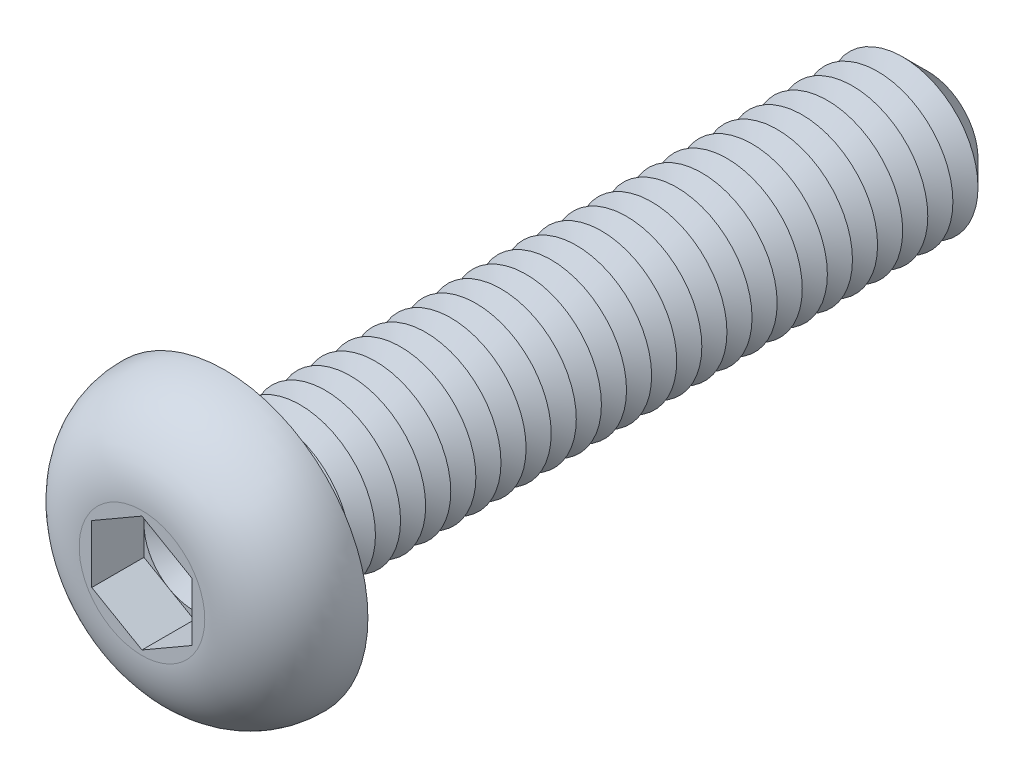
ISO-10303-21;
HEADER;
FILE_DESCRIPTION(('STEP AP214'),'2;1');
FILE_NAME('part.step','',(''),(''),'','','');
FILE_SCHEMA(('AUTOMOTIVE_DESIGN { 1 0 10303 214 1 1 1 1 }'));
ENDSEC;
DATA;
#1=APPLICATION_CONTEXT('core data for automotive mechanical design processes');
#2=APPLICATION_PROTOCOL_DEFINITION('international standard','automotive_design',2000,#1);
#3=PRODUCT_CONTEXT('',#1,'mechanical');
#4=PRODUCT('Part','Part','',(#3));
#5=PRODUCT_RELATED_PRODUCT_CATEGORY('part','',(#4));
#6=PRODUCT_DEFINITION_FORMATION('','',#4);
#7=PRODUCT_DEFINITION_CONTEXT('part definition',#1,'design');
#8=PRODUCT_DEFINITION('design','',#6,#7);
#9=PRODUCT_DEFINITION_SHAPE('','',#8);
#10=(LENGTH_UNIT() NAMED_UNIT(*) SI_UNIT(.MILLI.,.METRE.));
#11=(NAMED_UNIT(*) PLANE_ANGLE_UNIT() SI_UNIT($,.RADIAN.));
#12=(NAMED_UNIT(*) SI_UNIT($,.STERADIAN.) SOLID_ANGLE_UNIT());
#13=UNCERTAINTY_MEASURE_WITH_UNIT(LENGTH_MEASURE(1.E-05),#10,'distance_accuracy_value','');
#14=(GEOMETRIC_REPRESENTATION_CONTEXT(3) GLOBAL_UNCERTAINTY_ASSIGNED_CONTEXT((#13)) GLOBAL_UNIT_ASSIGNED_CONTEXT((#10,
#11,#12)) REPRESENTATION_CONTEXT('',''));
#15=CARTESIAN_POINT('',(0.,0.,0.));
#16=DIRECTION('',(0.,0.,1.));
#17=DIRECTION('',(1.,0.,0.));
#18=AXIS2_PLACEMENT_3D('',#15,#16,#17);
#19=CARTESIAN_POINT('',(0.,0.,0.61));
#20=DIRECTION('',(0.,0.,1.));
#21=DIRECTION('',(1.,0.,0.));
#22=AXIS2_PLACEMENT_3D('',#19,#20,#21);
#23=PLANE('',#22);
#24=CARTESIAN_POINT('',(0.,0.,0.61));
#25=DIRECTION('',(0.,0.,1.));
#26=DIRECTION('',(1.,0.,0.));
#27=AXIS2_PLACEMENT_3D('',#24,#25,#26);
#28=CIRCLE('',#27,1.);
#29=CARTESIAN_POINT('',(1.,0.,0.61));
#30=VERTEX_POINT('',#29);
#31=CARTESIAN_POINT('',(0.5,0.866025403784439,0.61));
#32=VERTEX_POINT('',#31);
#33=EDGE_CURVE('E117',#30,#32,#28,.T.);
#34=ORIENTED_EDGE('',*,*,#33,.F.);
#35=DIRECTION('',(0.,1.,0.));
#36=VECTOR('',#35,1.);
#37=CARTESIAN_POINT('',(1.,-0.577350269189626,0.61));
#38=LINE('',#37,#36);
#39=CARTESIAN_POINT('',(1.,0.577350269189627,0.61));
#40=VERTEX_POINT('',#39);
#41=EDGE_CURVE('E140',#30,#40,#38,.T.);
#42=ORIENTED_EDGE('',*,*,#41,.T.);
#43=DIRECTION('',(-0.866025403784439,0.5,0.));
#44=VECTOR('',#43,1.);
#45=CARTESIAN_POINT('',(1.,0.577350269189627,0.61));
#46=LINE('',#45,#44);
#47=EDGE_CURVE('E135',#40,#32,#46,.T.);
#48=ORIENTED_EDGE('',*,*,#47,.T.);
#49=EDGE_LOOP('',(#34,#42,#48));
#50=FACE_BOUND('',#49,.T.);
#51=ADVANCED_FACE('F39',(#50),#23,.T.);
#52=CARTESIAN_POINT('',(0.,0.,0.61));
#53=DIRECTION('',(0.,0.,1.));
#54=DIRECTION('',(1.,0.,0.));
#55=AXIS2_PLACEMENT_3D('',#52,#53,#54);
#56=CIRCLE('',#55,1.);
#57=CARTESIAN_POINT('',(-0.5,0.866025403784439,0.61));
#58=VERTEX_POINT('',#57);
#59=EDGE_CURVE('E11',#32,#58,#56,.T.);
#60=ORIENTED_EDGE('',*,*,#59,.F.);
#61=CARTESIAN_POINT('',(0.,1.15470053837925,0.61));
#62=VERTEX_POINT('',#61);
#63=EDGE_CURVE('E130',#32,#62,#46,.T.);
#64=ORIENTED_EDGE('',*,*,#63,.T.);
#65=DIRECTION('',(-0.866025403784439,-0.5,0.));
#66=VECTOR('',#65,1.);
#67=CARTESIAN_POINT('',(0.,1.15470053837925,0.61));
#68=LINE('',#67,#66);
#69=EDGE_CURVE('E132',#62,#58,#68,.T.);
#70=ORIENTED_EDGE('',*,*,#69,.T.);
#71=EDGE_LOOP('',(#60,#64,#70));
#72=FACE_BOUND('',#71,.T.);
#73=ADVANCED_FACE('F129',(#72),#23,.T.);
#74=CARTESIAN_POINT('',(-1.,0.,0.61));
#75=VERTEX_POINT('',#74);
#76=EDGE_CURVE('E49',#58,#75,#56,.T.);
#77=ORIENTED_EDGE('',*,*,#76,.F.);
#78=CARTESIAN_POINT('',(-1.,0.577350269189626,0.61));
#79=VERTEX_POINT('',#78);
#80=EDGE_CURVE('E143',#58,#79,#68,.T.);
#81=ORIENTED_EDGE('',*,*,#80,.T.);
#82=DIRECTION('',(0.,-1.,0.));
#83=VECTOR('',#82,1.);
#84=CARTESIAN_POINT('',(-1.,0.577350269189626,0.61));
#85=LINE('',#84,#83);
#86=EDGE_CURVE('E154',#79,#75,#85,.T.);
#87=ORIENTED_EDGE('',*,*,#86,.T.);
#88=EDGE_LOOP('',(#77,#81,#87));
#89=FACE_BOUND('',#88,.T.);
#90=ADVANCED_FACE('F253',(#89),#23,.T.);
#91=CARTESIAN_POINT('',(-0.5,-0.866025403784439,0.61));
#92=VERTEX_POINT('',#91);
#93=EDGE_CURVE('E233',#75,#92,#56,.T.);
#94=ORIENTED_EDGE('',*,*,#93,.F.);
#95=CARTESIAN_POINT('',(-1.,-0.577350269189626,0.61));
#96=VERTEX_POINT('',#95);
#97=EDGE_CURVE('E153',#75,#96,#85,.T.);
#98=ORIENTED_EDGE('',*,*,#97,.T.);
#99=DIRECTION('',(0.866025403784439,-0.5,0.));
#100=VECTOR('',#99,1.);
#101=CARTESIAN_POINT('',(-1.,-0.577350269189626,0.61));
#102=LINE('',#101,#100);
#103=EDGE_CURVE('E159',#96,#92,#102,.T.);
#104=ORIENTED_EDGE('',*,*,#103,.T.);
#105=EDGE_LOOP('',(#94,#98,#104));
#106=FACE_BOUND('',#105,.T.);
#107=ADVANCED_FACE('F246',(#106),#23,.T.);
#108=CARTESIAN_POINT('',(0.5,-0.866025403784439,0.61));
#109=VERTEX_POINT('',#108);
#110=EDGE_CURVE('E56',#92,#109,#56,.T.);
#111=ORIENTED_EDGE('',*,*,#110,.F.);
#112=CARTESIAN_POINT('',(0.,-1.15470053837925,0.61));
#113=VERTEX_POINT('',#112);
#114=EDGE_CURVE('E158',#92,#113,#102,.T.);
#115=ORIENTED_EDGE('',*,*,#114,.T.);
#116=DIRECTION('',(0.866025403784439,0.5,0.));
#117=VECTOR('',#116,1.);
#118=CARTESIAN_POINT('',(0.,-1.15470053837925,0.61));
#119=LINE('',#118,#117);
#120=EDGE_CURVE('E164',#113,#109,#119,.T.);
#121=ORIENTED_EDGE('',*,*,#120,.T.);
#122=EDGE_LOOP('',(#111,#115,#121));
#123=FACE_BOUND('',#122,.T.);
#124=ADVANCED_FACE('F492',(#123),#23,.T.);
#125=CARTESIAN_POINT('',(0.,0.,-14.));
#126=DIRECTION('',(0.,0.,1.));
#127=DIRECTION('',(1.,0.,0.));
#128=AXIS2_PLACEMENT_3D('',#125,#126,#127);
#129=CYLINDRICAL_SURFACE('',#128,1.5);
#130=CARTESIAN_POINT('',(0.,0.,-0.200000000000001));
#131=DIRECTION('',(0.,0.,1.));
#132=DIRECTION('',(1.,0.,0.));
#133=AXIS2_PLACEMENT_3D('',#130,#131,#132);
#134=CIRCLE('',#133,1.5);
#135=CARTESIAN_POINT('',(1.5,0.,-0.200000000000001));
#136=VERTEX_POINT('',#135);
#137=EDGE_CURVE('E221',#136,#136,#134,.F.);
#138=ORIENTED_EDGE('',*,*,#137,.T.);
#139=EDGE_LOOP('',(#138));
#140=FACE_BOUND('',#139,.T.);
#141=CARTESIAN_POINT('',(0.,0.,-0.5));
#142=DIRECTION('',(0.,0.,1.));
#143=DIRECTION('',(1.,0.,0.));
#144=AXIS2_PLACEMENT_3D('',#141,#142,#143);
#145=CIRCLE('',#144,1.50000000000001);
#146=CARTESIAN_POINT('',(1.50000000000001,0.,-0.5));
#147=VERTEX_POINT('',#146);
#148=EDGE_CURVE('E149',#147,#147,#145,.T.);
#149=ORIENTED_EDGE('',*,*,#148,.T.);
#150=EDGE_LOOP('',(#149));
#151=FACE_BOUND('',#150,.T.);
#152=ADVANCED_FACE('F498',(#140,#151),#129,.T.);
#153=CARTESIAN_POINT('',(0.,2.85,0.));
#154=DIRECTION('',(0.,0.,1.));
#155=DIRECTION('',(1.,0.,0.));
#156=AXIS2_PLACEMENT_3D('',#153,#154,#155);
#157=PLANE('',#156);
#158=CARTESIAN_POINT('',(0.,0.,0.));
#159=DIRECTION('',(0.,0.,1.));
#160=DIRECTION('',(1.,0.,0.));
#161=AXIS2_PLACEMENT_3D('',#158,#159,#160);
#162=CIRCLE('',#161,1.7);
#163=CARTESIAN_POINT('',(1.7,0.,0.));
#164=VERTEX_POINT('',#163);
#165=EDGE_CURVE('E224',#164,#164,#162,.T.);
#166=ORIENTED_EDGE('',*,*,#165,.T.);
#167=EDGE_LOOP('',(#166));
#168=FACE_BOUND('',#167,.T.);
#169=CARTESIAN_POINT('',(0.,0.,0.));
#170=DIRECTION('',(0.,0.,1.));
#171=DIRECTION('',(1.,0.,0.));
#172=AXIS2_PLACEMENT_3D('',#169,#170,#171);
#173=CIRCLE('',#172,2.85);
#174=CARTESIAN_POINT('',(2.85,0.,0.));
#175=VERTEX_POINT('',#174);
#176=EDGE_CURVE('E195',#175,#175,#173,.T.);
#177=ORIENTED_EDGE('',*,*,#176,.F.);
#178=EDGE_LOOP('',(#177));
#179=FACE_BOUND('',#178,.T.);
#180=ADVANCED_FACE('F503',(#168,#179),#157,.F.);
#181=CARTESIAN_POINT('',(0.,0.,1.65));
#182=DIRECTION('',(0.,0.,-1.));
#183=DIRECTION('',(-1.,0.,0.));
#184=AXIS2_PLACEMENT_3D('',#181,#182,#183);
#185=PLANE('',#184);
#186=DIRECTION('',(-0.866025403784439,-0.5,0.));
#187=VECTOR('',#186,1.);
#188=CARTESIAN_POINT('',(0.,1.15470053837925,1.65));
#189=LINE('',#188,#187);
#190=CARTESIAN_POINT('',(0.,1.15470053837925,1.65));
#191=VERTEX_POINT('',#190);
#192=CARTESIAN_POINT('',(-1.,0.577350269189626,1.65));
#193=VERTEX_POINT('',#192);
#194=EDGE_CURVE('E173',#191,#193,#189,.T.);
#195=ORIENTED_EDGE('',*,*,#194,.F.);
#196=DIRECTION('',(-0.866025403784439,0.5,0.));
#197=VECTOR('',#196,1.);
#198=CARTESIAN_POINT('',(1.,0.577350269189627,1.65));
#199=LINE('',#198,#197);
#200=CARTESIAN_POINT('',(1.,0.577350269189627,1.65));
#201=VERTEX_POINT('',#200);
#202=EDGE_CURVE('E64',#201,#191,#199,.T.);
#203=ORIENTED_EDGE('',*,*,#202,.F.);
#204=DIRECTION('',(0.,1.,0.));
#205=VECTOR('',#204,1.);
#206=CARTESIAN_POINT('',(1.,-0.577350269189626,1.65));
#207=LINE('',#206,#205);
#208=CARTESIAN_POINT('',(1.,-0.577350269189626,1.65));
#209=VERTEX_POINT('',#208);
#210=EDGE_CURVE('E138',#209,#201,#207,.T.);
#211=ORIENTED_EDGE('',*,*,#210,.F.);
#212=DIRECTION('',(0.866025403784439,0.5,0.));
#213=VECTOR('',#212,1.);
#214=CARTESIAN_POINT('',(0.,-1.15470053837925,1.65));
#215=LINE('',#214,#213);
#216=CARTESIAN_POINT('',(0.,-1.15470053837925,1.65));
#217=VERTEX_POINT('',#216);
#218=EDGE_CURVE('E185',#217,#209,#215,.T.);
#219=ORIENTED_EDGE('',*,*,#218,.F.);
#220=DIRECTION('',(0.866025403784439,-0.5,0.));
#221=VECTOR('',#220,1.);
#222=CARTESIAN_POINT('',(-1.,-0.577350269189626,1.65));
#223=LINE('',#222,#221);
#224=CARTESIAN_POINT('',(-1.,-0.577350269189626,1.65));
#225=VERTEX_POINT('',#224);
#226=EDGE_CURVE('E181',#225,#217,#223,.T.);
#227=ORIENTED_EDGE('',*,*,#226,.F.);
#228=DIRECTION('',(0.,-1.,0.));
#229=VECTOR('',#228,1.);
#230=CARTESIAN_POINT('',(-1.,0.577350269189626,1.65));
#231=LINE('',#230,#229);
#232=EDGE_CURVE('E177',#193,#225,#231,.T.);
#233=ORIENTED_EDGE('',*,*,#232,.F.);
#234=EDGE_LOOP('',(#195,#203,#211,#219,#227,#233));
#235=FACE_BOUND('',#234,.T.);
#236=CARTESIAN_POINT('',(0.,0.,1.65));
#237=DIRECTION('',(0.,0.,1.));
#238=DIRECTION('',(1.,0.,0.));
#239=AXIS2_PLACEMENT_3D('',#236,#237,#238);
#240=CIRCLE('',#239,1.25078144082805);
#241=CARTESIAN_POINT('',(1.25078144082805,0.,1.65));
#242=VERTEX_POINT('',#241);
#243=EDGE_CURVE('E213',#242,#242,#240,.T.);
#244=ORIENTED_EDGE('',*,*,#243,.T.);
#245=EDGE_LOOP('',(#244));
#246=FACE_BOUND('',#245,.T.);
#247=ADVANCED_FACE('F262',(#235,#246),#185,.F.);
#248=CARTESIAN_POINT('',(0.,0.,0.0499999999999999));
#249=DIRECTION('',(0.,0.,1.));
#250=DIRECTION('',(1.,0.,0.));
#251=AXIS2_PLACEMENT_3D('',#248,#249,#250);
#252=DEGENERATE_TOROIDAL_SURFACE('',#251,1.25078144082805,1.6,.T.);
#253=ORIENTED_EDGE('',*,*,#243,.F.);
#254=EDGE_LOOP('',(#253));
#255=FACE_BOUND('',#254,.T.);
#256=ORIENTED_EDGE('',*,*,#176,.T.);
#257=EDGE_LOOP('',(#256));
#258=FACE_BOUND('',#257,.T.);
#259=ADVANCED_FACE('F518',(#255,#258),#252,.T.);
#260=CARTESIAN_POINT('',(1.,0.577350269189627,0.61));
#261=DIRECTION('',(0.5,0.866025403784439,0.));
#262=DIRECTION('',(-0.866025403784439,0.5,0.));
#263=AXIS2_PLACEMENT_3D('',#260,#261,#262);
#264=PLANE('',#263);
#265=ORIENTED_EDGE('',*,*,#202,.T.);
#266=DIRECTION('',(0.,0.,1.));
#267=VECTOR('',#266,1.);
#268=CARTESIAN_POINT('',(0.,1.15470053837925,0.61));
#269=LINE('',#268,#267);
#270=EDGE_CURVE('E136',#62,#191,#269,.T.);
#271=ORIENTED_EDGE('',*,*,#270,.F.);
#272=ORIENTED_EDGE('',*,*,#63,.F.);
#273=ORIENTED_EDGE('',*,*,#47,.F.);
#274=DIRECTION('',(0.,0.,1.));
#275=VECTOR('',#274,1.);
#276=CARTESIAN_POINT('',(1.,0.577350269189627,0.61));
#277=LINE('',#276,#275);
#278=EDGE_CURVE('E192',#40,#201,#277,.T.);
#279=ORIENTED_EDGE('',*,*,#278,.T.);
#280=EDGE_LOOP('',(#265,#271,#272,#273,#279));
#281=FACE_BOUND('',#280,.T.);
#282=ADVANCED_FACE('F134',(#281),#264,.F.);
#283=CARTESIAN_POINT('',(1.,-0.577350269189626,0.61));
#284=DIRECTION('',(1.,0.,0.));
#285=DIRECTION('',(0.,0.,-1.));
#286=AXIS2_PLACEMENT_3D('',#283,#284,#285);
#287=PLANE('',#286);
#288=ORIENTED_EDGE('',*,*,#210,.T.);
#289=ORIENTED_EDGE('',*,*,#278,.F.);
#290=ORIENTED_EDGE('',*,*,#41,.F.);
#291=CARTESIAN_POINT('',(1.,-0.577350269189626,0.61));
#292=VERTEX_POINT('',#291);
#293=EDGE_CURVE('E167',#292,#30,#38,.T.);
#294=ORIENTED_EDGE('',*,*,#293,.F.);
#295=DIRECTION('',(0.,0.,1.));
#296=VECTOR('',#295,1.);
#297=CARTESIAN_POINT('',(1.,-0.577350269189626,0.61));
#298=LINE('',#297,#296);
#299=EDGE_CURVE('E196',#292,#209,#298,.T.);
#300=ORIENTED_EDGE('',*,*,#299,.T.);
#301=EDGE_LOOP('',(#288,#289,#290,#294,#300));
#302=FACE_BOUND('',#301,.T.);
#303=ADVANCED_FACE('F511',(#302),#287,.F.);
#304=CARTESIAN_POINT('',(0.,-1.15470053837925,0.61));
#305=DIRECTION('',(0.5,-0.866025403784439,0.));
#306=DIRECTION('',(0.866025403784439,0.5,0.));
#307=AXIS2_PLACEMENT_3D('',#304,#305,#306);
#308=PLANE('',#307);
#309=ORIENTED_EDGE('',*,*,#218,.T.);
#310=ORIENTED_EDGE('',*,*,#299,.F.);
#311=EDGE_CURVE('E163',#109,#292,#119,.T.);
#312=ORIENTED_EDGE('',*,*,#311,.F.);
#313=ORIENTED_EDGE('',*,*,#120,.F.);
#314=DIRECTION('',(0.,0.,1.));
#315=VECTOR('',#314,1.);
#316=CARTESIAN_POINT('',(0.,-1.15470053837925,0.61));
#317=LINE('',#316,#315);
#318=EDGE_CURVE('E199',#113,#217,#317,.T.);
#319=ORIENTED_EDGE('',*,*,#318,.T.);
#320=EDGE_LOOP('',(#309,#310,#312,#313,#319));
#321=FACE_BOUND('',#320,.T.);
#322=ADVANCED_FACE('F507',(#321),#308,.F.);
#323=CARTESIAN_POINT('',(-1.,-0.577350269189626,0.61));
#324=DIRECTION('',(-0.5,-0.866025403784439,0.));
#325=DIRECTION('',(0.866025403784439,-0.5,0.));
#326=AXIS2_PLACEMENT_3D('',#323,#324,#325);
#327=PLANE('',#326);
#328=ORIENTED_EDGE('',*,*,#226,.T.);
#329=ORIENTED_EDGE('',*,*,#318,.F.);
#330=ORIENTED_EDGE('',*,*,#114,.F.);
#331=ORIENTED_EDGE('',*,*,#103,.F.);
#332=DIRECTION('',(0.,0.,1.));
#333=VECTOR('',#332,1.);
#334=CARTESIAN_POINT('',(-1.,-0.577350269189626,0.61));
#335=LINE('',#334,#333);
#336=EDGE_CURVE('E202',#96,#225,#335,.T.);
#337=ORIENTED_EDGE('',*,*,#336,.T.);
#338=EDGE_LOOP('',(#328,#329,#330,#331,#337));
#339=FACE_BOUND('',#338,.T.);
#340=ADVANCED_FACE('F267',(#339),#327,.F.);
#341=CARTESIAN_POINT('',(-1.,0.577350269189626,0.61));
#342=DIRECTION('',(-1.,0.,0.));
#343=DIRECTION('',(0.,-1.,0.));
#344=AXIS2_PLACEMENT_3D('',#341,#342,#343);
#345=PLANE('',#344);
#346=ORIENTED_EDGE('',*,*,#232,.T.);
#347=ORIENTED_EDGE('',*,*,#336,.F.);
#348=ORIENTED_EDGE('',*,*,#97,.F.);
#349=ORIENTED_EDGE('',*,*,#86,.F.);
#350=DIRECTION('',(0.,0.,1.));
#351=VECTOR('',#350,1.);
#352=CARTESIAN_POINT('',(-1.,0.577350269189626,0.61));
#353=LINE('',#352,#351);
#354=EDGE_CURVE('E205',#79,#193,#353,.T.);
#355=ORIENTED_EDGE('',*,*,#354,.T.);
#356=EDGE_LOOP('',(#346,#347,#348,#349,#355));
#357=FACE_BOUND('',#356,.T.);
#358=ADVANCED_FACE('F251',(#357),#345,.F.);
#359=CARTESIAN_POINT('',(0.,1.15470053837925,0.61));
#360=DIRECTION('',(-0.5,0.866025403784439,0.));
#361=DIRECTION('',(-0.866025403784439,-0.5,0.));
#362=AXIS2_PLACEMENT_3D('',#359,#360,#361);
#363=PLANE('',#362);
#364=ORIENTED_EDGE('',*,*,#194,.T.);
#365=ORIENTED_EDGE('',*,*,#354,.F.);
#366=ORIENTED_EDGE('',*,*,#80,.F.);
#367=ORIENTED_EDGE('',*,*,#69,.F.);
#368=ORIENTED_EDGE('',*,*,#270,.T.);
#369=EDGE_LOOP('',(#364,#365,#366,#367,#368));
#370=FACE_BOUND('',#369,.T.);
#371=ADVANCED_FACE('F256',(#370),#363,.F.);
#372=EDGE_CURVE('E43',#109,#30,#56,.T.);
#373=ORIENTED_EDGE('',*,*,#372,.F.);
#374=ORIENTED_EDGE('',*,*,#311,.T.);
#375=ORIENTED_EDGE('',*,*,#293,.T.);
#376=EDGE_LOOP('',(#373,#374,#375));
#377=FACE_BOUND('',#376,.T.);
#378=ADVANCED_FACE('F481',(#377),#23,.T.);
#379=CARTESIAN_POINT('',(0.,0.,-0.5));
#380=DIRECTION('',(0.,0.,1.));
#381=DIRECTION('',(1.,0.,0.));
#382=AXIS2_PLACEMENT_3D('',#379,#380,#381);
#383=CONICAL_SURFACE('',#382,1.50000000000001,1.0471975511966);
#384=CARTESIAN_POINT('',(0.,0.,-0.750000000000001));
#385=DIRECTION('',(0.,0.,1.));
#386=DIRECTION('',(1.,0.,0.));
#387=AXIS2_PLACEMENT_3D('',#384,#385,#386);
#388=CIRCLE('',#387,1.06698729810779);
#389=CARTESIAN_POINT('',(1.06698729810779,0.,-0.750000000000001));
#390=VERTEX_POINT('',#389);
#391=EDGE_CURVE('E347',#390,#390,#388,.T.);
#392=ORIENTED_EDGE('',*,*,#391,.T.);
#393=EDGE_LOOP('',(#392));
#394=FACE_BOUND('',#393,.T.);
#395=ORIENTED_EDGE('',*,*,#148,.F.);
#396=EDGE_LOOP('',(#395));
#397=FACE_BOUND('',#396,.T.);
#398=ADVANCED_FACE('F466',(#394,#397),#383,.T.);
#399=CARTESIAN_POINT('',(0.,0.,-0.750000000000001));
#400=DIRECTION('',(0.,0.,-1.));
#401=DIRECTION('',(-1.,0.,0.));
#402=AXIS2_PLACEMENT_3D('',#399,#400,#401);
#403=CONICAL_SURFACE('',#402,1.06698729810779,1.0471975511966);
#404=CARTESIAN_POINT('',(0.,0.,-1.));
#405=DIRECTION('',(0.,0.,1.));
#406=DIRECTION('',(1.,0.,0.));
#407=AXIS2_PLACEMENT_3D('',#404,#405,#406);
#408=CIRCLE('',#407,1.50000000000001);
#409=CARTESIAN_POINT('',(1.50000000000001,0.,-1.));
#410=VERTEX_POINT('',#409);
#411=EDGE_CURVE('E326',#410,#410,#408,.T.);
#412=ORIENTED_EDGE('',*,*,#411,.T.);
#413=EDGE_LOOP('',(#412));
#414=FACE_BOUND('',#413,.T.);
#415=ORIENTED_EDGE('',*,*,#391,.F.);
#416=EDGE_LOOP('',(#415));
#417=FACE_BOUND('',#416,.T.);
#418=ADVANCED_FACE('F469',(#414,#417),#403,.T.);
#419=CARTESIAN_POINT('',(0.,0.,-1.));
#420=DIRECTION('',(0.,0.,1.));
#421=DIRECTION('',(1.,0.,0.));
#422=AXIS2_PLACEMENT_3D('',#419,#420,#421);
#423=CONICAL_SURFACE('',#422,1.50000000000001,1.0471975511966);
#424=CARTESIAN_POINT('',(0.,0.,-1.25));
#425=DIRECTION('',(0.,0.,1.));
#426=DIRECTION('',(1.,0.,0.));
#427=AXIS2_PLACEMENT_3D('',#424,#425,#426);
#428=CIRCLE('',#427,1.06698729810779);
#429=CARTESIAN_POINT('',(1.06698729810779,0.,-1.25));
#430=VERTEX_POINT('',#429);
#431=EDGE_CURVE('E323',#430,#430,#428,.T.);
#432=ORIENTED_EDGE('',*,*,#431,.T.);
#433=EDGE_LOOP('',(#432));
#434=FACE_BOUND('',#433,.T.);
#435=ORIENTED_EDGE('',*,*,#411,.F.);
#436=EDGE_LOOP('',(#435));
#437=FACE_BOUND('',#436,.T.);
#438=ADVANCED_FACE('F471',(#434,#437),#423,.T.);
#439=CARTESIAN_POINT('',(0.,0.,-1.25));
#440=DIRECTION('',(0.,0.,-1.));
#441=DIRECTION('',(-1.,0.,0.));
#442=AXIS2_PLACEMENT_3D('',#439,#440,#441);
#443=CONICAL_SURFACE('',#442,1.06698729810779,1.0471975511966);
#444=CARTESIAN_POINT('',(0.,0.,-1.5));
#445=DIRECTION('',(0.,0.,1.));
#446=DIRECTION('',(1.,0.,0.));
#447=AXIS2_PLACEMENT_3D('',#444,#445,#446);
#448=CIRCLE('',#447,1.50000000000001);
#449=CARTESIAN_POINT('',(1.50000000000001,0.,-1.5));
#450=VERTEX_POINT('',#449);
#451=EDGE_CURVE('E327',#450,#450,#448,.T.);
#452=ORIENTED_EDGE('',*,*,#451,.T.);
#453=EDGE_LOOP('',(#452));
#454=FACE_BOUND('',#453,.T.);
#455=ORIENTED_EDGE('',*,*,#431,.F.);
#456=EDGE_LOOP('',(#455));
#457=FACE_BOUND('',#456,.T.);
#458=ADVANCED_FACE('F478',(#454,#457),#443,.T.);
#459=CARTESIAN_POINT('',(0.,0.,-1.5));
#460=DIRECTION('',(0.,0.,1.));
#461=DIRECTION('',(1.,0.,0.));
#462=AXIS2_PLACEMENT_3D('',#459,#460,#461);
#463=CONICAL_SURFACE('',#462,1.50000000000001,1.0471975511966);
#464=CARTESIAN_POINT('',(0.,0.,-1.75));
#465=DIRECTION('',(0.,0.,1.));
#466=DIRECTION('',(1.,0.,0.));
#467=AXIS2_PLACEMENT_3D('',#464,#465,#466);
#468=CIRCLE('',#467,1.06698729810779);
#469=CARTESIAN_POINT('',(1.06698729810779,0.,-1.75));
#470=VERTEX_POINT('',#469);
#471=EDGE_CURVE('E310',#470,#470,#468,.T.);
#472=ORIENTED_EDGE('',*,*,#471,.T.);
#473=EDGE_LOOP('',(#472));
#474=FACE_BOUND('',#473,.T.);
#475=ORIENTED_EDGE('',*,*,#451,.F.);
#476=EDGE_LOOP('',(#475));
#477=FACE_BOUND('',#476,.T.);
#478=ADVANCED_FACE('F748',(#474,#477),#463,.T.);
#479=CARTESIAN_POINT('',(0.,0.,-1.75));
#480=DIRECTION('',(0.,0.,-1.));
#481=DIRECTION('',(-1.,0.,0.));
#482=AXIS2_PLACEMENT_3D('',#479,#480,#481);
#483=CONICAL_SURFACE('',#482,1.06698729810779,1.0471975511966);
#484=CARTESIAN_POINT('',(0.,0.,-2.));
#485=DIRECTION('',(0.,0.,1.));
#486=DIRECTION('',(1.,0.,0.));
#487=AXIS2_PLACEMENT_3D('',#484,#485,#486);
#488=CIRCLE('',#487,1.50000000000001);
#489=CARTESIAN_POINT('',(1.50000000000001,0.,-2.));
#490=VERTEX_POINT('',#489);
#491=EDGE_CURVE('E307',#490,#490,#488,.T.);
#492=ORIENTED_EDGE('',*,*,#491,.T.);
#493=EDGE_LOOP('',(#492));
#494=FACE_BOUND('',#493,.T.);
#495=ORIENTED_EDGE('',*,*,#471,.F.);
#496=EDGE_LOOP('',(#495));
#497=FACE_BOUND('',#496,.T.);
#498=ADVANCED_FACE('F744',(#494,#497),#483,.T.);
#499=CARTESIAN_POINT('',(0.,0.,-2.));
#500=DIRECTION('',(0.,0.,1.));
#501=DIRECTION('',(1.,0.,0.));
#502=AXIS2_PLACEMENT_3D('',#499,#500,#501);
#503=CONICAL_SURFACE('',#502,1.50000000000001,1.0471975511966);
#504=CARTESIAN_POINT('',(0.,0.,-2.25));
#505=DIRECTION('',(0.,0.,1.));
#506=DIRECTION('',(1.,0.,0.));
#507=AXIS2_PLACEMENT_3D('',#504,#505,#506);
#508=CIRCLE('',#507,1.06698729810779);
#509=CARTESIAN_POINT('',(1.06698729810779,0.,-2.25));
#510=VERTEX_POINT('',#509);
#511=EDGE_CURVE('E311',#510,#510,#508,.T.);
#512=ORIENTED_EDGE('',*,*,#511,.T.);
#513=EDGE_LOOP('',(#512));
#514=FACE_BOUND('',#513,.T.);
#515=ORIENTED_EDGE('',*,*,#491,.F.);
#516=EDGE_LOOP('',(#515));
#517=FACE_BOUND('',#516,.T.);
#518=ADVANCED_FACE('F740',(#514,#517),#503,.T.);
#519=CARTESIAN_POINT('',(0.,0.,-2.25));
#520=DIRECTION('',(0.,0.,-1.));
#521=DIRECTION('',(-1.,0.,0.));
#522=AXIS2_PLACEMENT_3D('',#519,#520,#521);
#523=CONICAL_SURFACE('',#522,1.06698729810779,1.0471975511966);
#524=CARTESIAN_POINT('',(0.,0.,-2.5));
#525=DIRECTION('',(0.,0.,1.));
#526=DIRECTION('',(1.,0.,0.));
#527=AXIS2_PLACEMENT_3D('',#524,#525,#526);
#528=CIRCLE('',#527,1.50000000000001);
#529=CARTESIAN_POINT('',(1.50000000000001,0.,-2.5));
#530=VERTEX_POINT('',#529);
#531=EDGE_CURVE('E448',#530,#530,#528,.T.);
#532=ORIENTED_EDGE('',*,*,#531,.T.);
#533=EDGE_LOOP('',(#532));
#534=FACE_BOUND('',#533,.T.);
#535=ORIENTED_EDGE('',*,*,#511,.F.);
#536=EDGE_LOOP('',(#535));
#537=FACE_BOUND('',#536,.T.);
#538=ADVANCED_FACE('F736',(#534,#537),#523,.T.);
#539=CARTESIAN_POINT('',(0.,0.,-2.5));
#540=DIRECTION('',(0.,0.,1.));
#541=DIRECTION('',(1.,0.,0.));
#542=AXIS2_PLACEMENT_3D('',#539,#540,#541);
#543=CONICAL_SURFACE('',#542,1.50000000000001,1.0471975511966);
#544=CARTESIAN_POINT('',(0.,0.,-2.75));
#545=DIRECTION('',(0.,0.,1.));
#546=DIRECTION('',(1.,0.,0.));
#547=AXIS2_PLACEMENT_3D('',#544,#545,#546);
#548=CIRCLE('',#547,1.06698729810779);
#549=CARTESIAN_POINT('',(1.06698729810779,0.,-2.75));
#550=VERTEX_POINT('',#549);
#551=EDGE_CURVE('E444',#550,#550,#548,.T.);
#552=ORIENTED_EDGE('',*,*,#551,.T.);
#553=EDGE_LOOP('',(#552));
#554=FACE_BOUND('',#553,.T.);
#555=ORIENTED_EDGE('',*,*,#531,.F.);
#556=EDGE_LOOP('',(#555));
#557=FACE_BOUND('',#556,.T.);
#558=ADVANCED_FACE('F732',(#554,#557),#543,.T.);
#559=CARTESIAN_POINT('',(0.,0.,-2.75));
#560=DIRECTION('',(0.,0.,-1.));
#561=DIRECTION('',(-1.,0.,0.));
#562=AXIS2_PLACEMENT_3D('',#559,#560,#561);
#563=CONICAL_SURFACE('',#562,1.06698729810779,1.0471975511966);
#564=CARTESIAN_POINT('',(0.,0.,-3.));
#565=DIRECTION('',(0.,0.,1.));
#566=DIRECTION('',(1.,0.,0.));
#567=AXIS2_PLACEMENT_3D('',#564,#565,#566);
#568=CIRCLE('',#567,1.50000000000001);
#569=CARTESIAN_POINT('',(1.50000000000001,0.,-3.));
#570=VERTEX_POINT('',#569);
#571=EDGE_CURVE('E332',#570,#570,#568,.T.);
#572=ORIENTED_EDGE('',*,*,#571,.T.);
#573=EDGE_LOOP('',(#572));
#574=FACE_BOUND('',#573,.T.);
#575=ORIENTED_EDGE('',*,*,#551,.F.);
#576=EDGE_LOOP('',(#575));
#577=FACE_BOUND('',#576,.T.);
#578=ADVANCED_FACE('F728',(#574,#577),#563,.T.);
#579=CARTESIAN_POINT('',(0.,0.,-3.));
#580=DIRECTION('',(0.,0.,1.));
#581=DIRECTION('',(1.,0.,0.));
#582=AXIS2_PLACEMENT_3D('',#579,#580,#581);
#583=CONICAL_SURFACE('',#582,1.50000000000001,1.0471975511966);
#584=CARTESIAN_POINT('',(0.,0.,-3.25));
#585=DIRECTION('',(0.,0.,1.));
#586=DIRECTION('',(1.,0.,0.));
#587=AXIS2_PLACEMENT_3D('',#584,#585,#586);
#588=CIRCLE('',#587,1.06698729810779);
#589=CARTESIAN_POINT('',(1.06698729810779,0.,-3.25));
#590=VERTEX_POINT('',#589);
#591=EDGE_CURVE('E329',#590,#590,#588,.T.);
#592=ORIENTED_EDGE('',*,*,#591,.T.);
#593=EDGE_LOOP('',(#592));
#594=FACE_BOUND('',#593,.T.);
#595=ORIENTED_EDGE('',*,*,#571,.F.);
#596=EDGE_LOOP('',(#595));
#597=FACE_BOUND('',#596,.T.);
#598=ADVANCED_FACE('F724',(#594,#597),#583,.T.);
#599=CARTESIAN_POINT('',(0.,0.,-3.25));
#600=DIRECTION('',(0.,0.,-1.));
#601=DIRECTION('',(-1.,0.,0.));
#602=AXIS2_PLACEMENT_3D('',#599,#600,#601);
#603=CONICAL_SURFACE('',#602,1.06698729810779,1.0471975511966);
#604=CARTESIAN_POINT('',(0.,0.,-3.5));
#605=DIRECTION('',(0.,0.,1.));
#606=DIRECTION('',(1.,0.,0.));
#607=AXIS2_PLACEMENT_3D('',#604,#605,#606);
#608=CIRCLE('',#607,1.50000000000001);
#609=CARTESIAN_POINT('',(1.50000000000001,0.,-3.5));
#610=VERTEX_POINT('',#609);
#611=EDGE_CURVE('E333',#610,#610,#608,.T.);
#612=ORIENTED_EDGE('',*,*,#611,.T.);
#613=EDGE_LOOP('',(#612));
#614=FACE_BOUND('',#613,.T.);
#615=ORIENTED_EDGE('',*,*,#591,.F.);
#616=EDGE_LOOP('',(#615));
#617=FACE_BOUND('',#616,.T.);
#618=ADVANCED_FACE('F720',(#614,#617),#603,.T.);
#619=CARTESIAN_POINT('',(0.,0.,-3.5));
#620=DIRECTION('',(0.,0.,1.));
#621=DIRECTION('',(1.,0.,0.));
#622=AXIS2_PLACEMENT_3D('',#619,#620,#621);
#623=CONICAL_SURFACE('',#622,1.50000000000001,1.0471975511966);
#624=CARTESIAN_POINT('',(0.,0.,-3.75));
#625=DIRECTION('',(0.,0.,1.));
#626=DIRECTION('',(1.,0.,0.));
#627=AXIS2_PLACEMENT_3D('',#624,#625,#626);
#628=CIRCLE('',#627,1.06698729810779);
#629=CARTESIAN_POINT('',(1.06698729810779,0.,-3.75));
#630=VERTEX_POINT('',#629);
#631=EDGE_CURVE('E435',#630,#630,#628,.T.);
#632=ORIENTED_EDGE('',*,*,#631,.T.);
#633=EDGE_LOOP('',(#632));
#634=FACE_BOUND('',#633,.T.);
#635=ORIENTED_EDGE('',*,*,#611,.F.);
#636=EDGE_LOOP('',(#635));
#637=FACE_BOUND('',#636,.T.);
#638=ADVANCED_FACE('F716',(#634,#637),#623,.T.);
#639=CARTESIAN_POINT('',(0.,0.,-3.75));
#640=DIRECTION('',(0.,0.,-1.));
#641=DIRECTION('',(-1.,0.,0.));
#642=AXIS2_PLACEMENT_3D('',#639,#640,#641);
#643=CONICAL_SURFACE('',#642,1.06698729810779,1.0471975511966);
#644=CARTESIAN_POINT('',(0.,0.,-4.));
#645=DIRECTION('',(0.,0.,1.));
#646=DIRECTION('',(1.,0.,0.));
#647=AXIS2_PLACEMENT_3D('',#644,#645,#646);
#648=CIRCLE('',#647,1.50000000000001);
#649=CARTESIAN_POINT('',(1.50000000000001,0.,-4.));
#650=VERTEX_POINT('',#649);
#651=EDGE_CURVE('E316',#650,#650,#648,.T.);
#652=ORIENTED_EDGE('',*,*,#651,.T.);
#653=EDGE_LOOP('',(#652));
#654=FACE_BOUND('',#653,.T.);
#655=ORIENTED_EDGE('',*,*,#631,.F.);
#656=EDGE_LOOP('',(#655));
#657=FACE_BOUND('',#656,.T.);
#658=ADVANCED_FACE('F712',(#654,#657),#643,.T.);
#659=CARTESIAN_POINT('',(0.,0.,-4.));
#660=DIRECTION('',(0.,0.,1.));
#661=DIRECTION('',(1.,0.,0.));
#662=AXIS2_PLACEMENT_3D('',#659,#660,#661);
#663=CONICAL_SURFACE('',#662,1.50000000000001,1.0471975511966);
#664=CARTESIAN_POINT('',(0.,0.,-4.25));
#665=DIRECTION('',(0.,0.,1.));
#666=DIRECTION('',(1.,0.,0.));
#667=AXIS2_PLACEMENT_3D('',#664,#665,#666);
#668=CIRCLE('',#667,1.06698729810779);
#669=CARTESIAN_POINT('',(1.06698729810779,0.,-4.25));
#670=VERTEX_POINT('',#669);
#671=EDGE_CURVE('E313',#670,#670,#668,.T.);
#672=ORIENTED_EDGE('',*,*,#671,.T.);
#673=EDGE_LOOP('',(#672));
#674=FACE_BOUND('',#673,.T.);
#675=ORIENTED_EDGE('',*,*,#651,.F.);
#676=EDGE_LOOP('',(#675));
#677=FACE_BOUND('',#676,.T.);
#678=ADVANCED_FACE('F708',(#674,#677),#663,.T.);
#679=CARTESIAN_POINT('',(0.,0.,-4.25));
#680=DIRECTION('',(0.,0.,-1.));
#681=DIRECTION('',(-1.,0.,0.));
#682=AXIS2_PLACEMENT_3D('',#679,#680,#681);
#683=CONICAL_SURFACE('',#682,1.06698729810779,1.0471975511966);
#684=CARTESIAN_POINT('',(0.,0.,-4.5));
#685=DIRECTION('',(0.,0.,1.));
#686=DIRECTION('',(1.,0.,0.));
#687=AXIS2_PLACEMENT_3D('',#684,#685,#686);
#688=CIRCLE('',#687,1.50000000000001);
#689=CARTESIAN_POINT('',(1.50000000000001,0.,-4.5));
#690=VERTEX_POINT('',#689);
#691=EDGE_CURVE('E317',#690,#690,#688,.T.);
#692=ORIENTED_EDGE('',*,*,#691,.T.);
#693=EDGE_LOOP('',(#692));
#694=FACE_BOUND('',#693,.T.);
#695=ORIENTED_EDGE('',*,*,#671,.F.);
#696=EDGE_LOOP('',(#695));
#697=FACE_BOUND('',#696,.T.);
#698=ADVANCED_FACE('F704',(#694,#697),#683,.T.);
#699=CARTESIAN_POINT('',(0.,0.,-4.5));
#700=DIRECTION('',(0.,0.,1.));
#701=DIRECTION('',(1.,0.,0.));
#702=AXIS2_PLACEMENT_3D('',#699,#700,#701);
#703=CONICAL_SURFACE('',#702,1.50000000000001,1.0471975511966);
#704=CARTESIAN_POINT('',(0.,0.,-4.75));
#705=DIRECTION('',(0.,0.,1.));
#706=DIRECTION('',(1.,0.,0.));
#707=AXIS2_PLACEMENT_3D('',#704,#705,#706);
#708=CIRCLE('',#707,1.06698729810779);
#709=CARTESIAN_POINT('',(1.06698729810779,0.,-4.75));
#710=VERTEX_POINT('',#709);
#711=EDGE_CURVE('E294',#710,#710,#708,.T.);
#712=ORIENTED_EDGE('',*,*,#711,.T.);
#713=EDGE_LOOP('',(#712));
#714=FACE_BOUND('',#713,.T.);
#715=ORIENTED_EDGE('',*,*,#691,.F.);
#716=EDGE_LOOP('',(#715));
#717=FACE_BOUND('',#716,.T.);
#718=ADVANCED_FACE('F700',(#714,#717),#703,.T.);
#719=CARTESIAN_POINT('',(0.,0.,-4.75));
#720=DIRECTION('',(0.,0.,-1.));
#721=DIRECTION('',(-1.,0.,0.));
#722=AXIS2_PLACEMENT_3D('',#719,#720,#721);
#723=CONICAL_SURFACE('',#722,1.06698729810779,1.0471975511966);
#724=CARTESIAN_POINT('',(0.,0.,-5.));
#725=DIRECTION('',(0.,0.,1.));
#726=DIRECTION('',(1.,0.,0.));
#727=AXIS2_PLACEMENT_3D('',#724,#725,#726);
#728=CIRCLE('',#727,1.50000000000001);
#729=CARTESIAN_POINT('',(1.50000000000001,0.,-5.));
#730=VERTEX_POINT('',#729);
#731=EDGE_CURVE('E291',#730,#730,#728,.T.);
#732=ORIENTED_EDGE('',*,*,#731,.T.);
#733=EDGE_LOOP('',(#732));
#734=FACE_BOUND('',#733,.T.);
#735=ORIENTED_EDGE('',*,*,#711,.F.);
#736=EDGE_LOOP('',(#735));
#737=FACE_BOUND('',#736,.T.);
#738=ADVANCED_FACE('F696',(#734,#737),#723,.T.);
#739=CARTESIAN_POINT('',(0.,0.,-5.));
#740=DIRECTION('',(0.,0.,1.));
#741=DIRECTION('',(1.,0.,0.));
#742=AXIS2_PLACEMENT_3D('',#739,#740,#741);
#743=CONICAL_SURFACE('',#742,1.50000000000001,1.0471975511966);
#744=CARTESIAN_POINT('',(0.,0.,-5.25));
#745=DIRECTION('',(0.,0.,1.));
#746=DIRECTION('',(1.,0.,0.));
#747=AXIS2_PLACEMENT_3D('',#744,#745,#746);
#748=CIRCLE('',#747,1.06698729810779);
#749=CARTESIAN_POINT('',(1.06698729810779,0.,-5.25));
#750=VERTEX_POINT('',#749);
#751=EDGE_CURVE('E295',#750,#750,#748,.T.);
#752=ORIENTED_EDGE('',*,*,#751,.T.);
#753=EDGE_LOOP('',(#752));
#754=FACE_BOUND('',#753,.T.);
#755=ORIENTED_EDGE('',*,*,#731,.F.);
#756=EDGE_LOOP('',(#755));
#757=FACE_BOUND('',#756,.T.);
#758=ADVANCED_FACE('F692',(#754,#757),#743,.T.);
#759=CARTESIAN_POINT('',(0.,0.,-5.25));
#760=DIRECTION('',(0.,0.,-1.));
#761=DIRECTION('',(-1.,0.,0.));
#762=AXIS2_PLACEMENT_3D('',#759,#760,#761);
#763=CONICAL_SURFACE('',#762,1.06698729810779,1.0471975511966);
#764=CARTESIAN_POINT('',(0.,0.,-5.5));
#765=DIRECTION('',(0.,0.,1.));
#766=DIRECTION('',(1.,0.,0.));
#767=AXIS2_PLACEMENT_3D('',#764,#765,#766);
#768=CIRCLE('',#767,1.50000000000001);
#769=CARTESIAN_POINT('',(1.50000000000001,0.,-5.5));
#770=VERTEX_POINT('',#769);
#771=EDGE_CURVE('E419',#770,#770,#768,.T.);
#772=ORIENTED_EDGE('',*,*,#771,.T.);
#773=EDGE_LOOP('',(#772));
#774=FACE_BOUND('',#773,.T.);
#775=ORIENTED_EDGE('',*,*,#751,.F.);
#776=EDGE_LOOP('',(#775));
#777=FACE_BOUND('',#776,.T.);
#778=ADVANCED_FACE('F688',(#774,#777),#763,.T.);
#779=CARTESIAN_POINT('',(0.,0.,-5.5));
#780=DIRECTION('',(0.,0.,1.));
#781=DIRECTION('',(1.,0.,0.));
#782=AXIS2_PLACEMENT_3D('',#779,#780,#781);
#783=CONICAL_SURFACE('',#782,1.50000000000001,1.0471975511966);
#784=CARTESIAN_POINT('',(0.,0.,-5.75));
#785=DIRECTION('',(0.,0.,1.));
#786=DIRECTION('',(1.,0.,0.));
#787=AXIS2_PLACEMENT_3D('',#784,#785,#786);
#788=CIRCLE('',#787,1.06698729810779);
#789=CARTESIAN_POINT('',(1.06698729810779,0.,-5.75));
#790=VERTEX_POINT('',#789);
#791=EDGE_CURVE('E276',#790,#790,#788,.T.);
#792=ORIENTED_EDGE('',*,*,#791,.T.);
#793=EDGE_LOOP('',(#792));
#794=FACE_BOUND('',#793,.T.);
#795=ORIENTED_EDGE('',*,*,#771,.F.);
#796=EDGE_LOOP('',(#795));
#797=FACE_BOUND('',#796,.T.);
#798=ADVANCED_FACE('F684',(#794,#797),#783,.T.);
#799=CARTESIAN_POINT('',(0.,0.,-5.75));
#800=DIRECTION('',(0.,0.,-1.));
#801=DIRECTION('',(-1.,0.,0.));
#802=AXIS2_PLACEMENT_3D('',#799,#800,#801);
#803=CONICAL_SURFACE('',#802,1.06698729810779,1.0471975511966);
#804=CARTESIAN_POINT('',(0.,0.,-6.));
#805=DIRECTION('',(0.,0.,1.));
#806=DIRECTION('',(1.,0.,0.));
#807=AXIS2_PLACEMENT_3D('',#804,#805,#806);
#808=CIRCLE('',#807,1.50000000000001);
#809=CARTESIAN_POINT('',(1.50000000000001,0.,-6.));
#810=VERTEX_POINT('',#809);
#811=EDGE_CURVE('E273',#810,#810,#808,.T.);
#812=ORIENTED_EDGE('',*,*,#811,.T.);
#813=EDGE_LOOP('',(#812));
#814=FACE_BOUND('',#813,.T.);
#815=ORIENTED_EDGE('',*,*,#791,.F.);
#816=EDGE_LOOP('',(#815));
#817=FACE_BOUND('',#816,.T.);
#818=ADVANCED_FACE('F680',(#814,#817),#803,.T.);
#819=CARTESIAN_POINT('',(0.,0.,-6.));
#820=DIRECTION('',(0.,0.,1.));
#821=DIRECTION('',(1.,0.,0.));
#822=AXIS2_PLACEMENT_3D('',#819,#820,#821);
#823=CONICAL_SURFACE('',#822,1.50000000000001,1.0471975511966);
#824=CARTESIAN_POINT('',(0.,0.,-6.25));
#825=DIRECTION('',(0.,0.,1.));
#826=DIRECTION('',(1.,0.,0.));
#827=AXIS2_PLACEMENT_3D('',#824,#825,#826);
#828=CIRCLE('',#827,1.06698729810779);
#829=CARTESIAN_POINT('',(1.06698729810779,0.,-6.25));
#830=VERTEX_POINT('',#829);
#831=EDGE_CURVE('E277',#830,#830,#828,.T.);
#832=ORIENTED_EDGE('',*,*,#831,.T.);
#833=EDGE_LOOP('',(#832));
#834=FACE_BOUND('',#833,.T.);
#835=ORIENTED_EDGE('',*,*,#811,.F.);
#836=EDGE_LOOP('',(#835));
#837=FACE_BOUND('',#836,.T.);
#838=ADVANCED_FACE('F676',(#834,#837),#823,.T.);
#839=CARTESIAN_POINT('',(0.,0.,-6.25));
#840=DIRECTION('',(0.,0.,-1.));
#841=DIRECTION('',(-1.,0.,0.));
#842=AXIS2_PLACEMENT_3D('',#839,#840,#841);
#843=CONICAL_SURFACE('',#842,1.06698729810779,1.0471975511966);
#844=CARTESIAN_POINT('',(0.,0.,-6.5));
#845=DIRECTION('',(0.,0.,1.));
#846=DIRECTION('',(1.,0.,0.));
#847=AXIS2_PLACEMENT_3D('',#844,#845,#846);
#848=CIRCLE('',#847,1.50000000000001);
#849=CARTESIAN_POINT('',(1.50000000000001,0.,-6.5));
#850=VERTEX_POINT('',#849);
#851=EDGE_CURVE('E335',#850,#850,#848,.T.);
#852=ORIENTED_EDGE('',*,*,#851,.T.);
#853=EDGE_LOOP('',(#852));
#854=FACE_BOUND('',#853,.T.);
#855=ORIENTED_EDGE('',*,*,#831,.F.);
#856=EDGE_LOOP('',(#855));
#857=FACE_BOUND('',#856,.T.);
#858=ADVANCED_FACE('F672',(#854,#857),#843,.T.);
#859=CARTESIAN_POINT('',(0.,0.,-6.5));
#860=DIRECTION('',(0.,0.,1.));
#861=DIRECTION('',(1.,0.,0.));
#862=AXIS2_PLACEMENT_3D('',#859,#860,#861);
#863=CONICAL_SURFACE('',#862,1.50000000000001,1.0471975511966);
#864=CARTESIAN_POINT('',(0.,0.,-6.75));
#865=DIRECTION('',(0.,0.,1.));
#866=DIRECTION('',(1.,0.,0.));
#867=AXIS2_PLACEMENT_3D('',#864,#865,#866);
#868=CIRCLE('',#867,1.06698729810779);
#869=CARTESIAN_POINT('',(1.06698729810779,0.,-6.75));
#870=VERTEX_POINT('',#869);
#871=EDGE_CURVE('E338',#870,#870,#868,.T.);
#872=ORIENTED_EDGE('',*,*,#871,.T.);
#873=EDGE_LOOP('',(#872));
#874=FACE_BOUND('',#873,.T.);
#875=ORIENTED_EDGE('',*,*,#851,.F.);
#876=EDGE_LOOP('',(#875));
#877=FACE_BOUND('',#876,.T.);
#878=ADVANCED_FACE('F668',(#874,#877),#863,.T.);
#879=CARTESIAN_POINT('',(0.,0.,-6.75));
#880=DIRECTION('',(0.,0.,-1.));
#881=DIRECTION('',(-1.,0.,0.));
#882=AXIS2_PLACEMENT_3D('',#879,#880,#881);
#883=CONICAL_SURFACE('',#882,1.06698729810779,1.0471975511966);
#884=CARTESIAN_POINT('',(0.,0.,-7.));
#885=DIRECTION('',(0.,0.,1.));
#886=DIRECTION('',(1.,0.,0.));
#887=AXIS2_PLACEMENT_3D('',#884,#885,#886);
#888=CIRCLE('',#887,1.50000000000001);
#889=CARTESIAN_POINT('',(1.50000000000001,0.,-7.));
#890=VERTEX_POINT('',#889);
#891=EDGE_CURVE('E409',#890,#890,#888,.T.);
#892=ORIENTED_EDGE('',*,*,#891,.T.);
#893=EDGE_LOOP('',(#892));
#894=FACE_BOUND('',#893,.T.);
#895=ORIENTED_EDGE('',*,*,#871,.F.);
#896=EDGE_LOOP('',(#895));
#897=FACE_BOUND('',#896,.T.);
#898=ADVANCED_FACE('F664',(#894,#897),#883,.T.);
#899=CARTESIAN_POINT('',(0.,0.,-7.));
#900=DIRECTION('',(0.,0.,1.));
#901=DIRECTION('',(1.,0.,0.));
#902=AXIS2_PLACEMENT_3D('',#899,#900,#901);
#903=CONICAL_SURFACE('',#902,1.50000000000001,1.0471975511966);
#904=CARTESIAN_POINT('',(0.,0.,-7.25));
#905=DIRECTION('',(0.,0.,1.));
#906=DIRECTION('',(1.,0.,0.));
#907=AXIS2_PLACEMENT_3D('',#904,#905,#906);
#908=CIRCLE('',#907,1.06698729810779);
#909=CARTESIAN_POINT('',(1.06698729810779,0.,-7.25));
#910=VERTEX_POINT('',#909);
#911=EDGE_CURVE('E405',#910,#910,#908,.T.);
#912=ORIENTED_EDGE('',*,*,#911,.T.);
#913=EDGE_LOOP('',(#912));
#914=FACE_BOUND('',#913,.T.);
#915=ORIENTED_EDGE('',*,*,#891,.F.);
#916=EDGE_LOOP('',(#915));
#917=FACE_BOUND('',#916,.T.);
#918=ADVANCED_FACE('F660',(#914,#917),#903,.T.);
#919=CARTESIAN_POINT('',(0.,0.,-7.25));
#920=DIRECTION('',(0.,0.,-1.));
#921=DIRECTION('',(-1.,0.,0.));
#922=AXIS2_PLACEMENT_3D('',#919,#920,#921);
#923=CONICAL_SURFACE('',#922,1.06698729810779,1.0471975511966);
#924=CARTESIAN_POINT('',(0.,0.,-7.5));
#925=DIRECTION('',(0.,0.,1.));
#926=DIRECTION('',(1.,0.,0.));
#927=AXIS2_PLACEMENT_3D('',#924,#925,#926);
#928=CIRCLE('',#927,1.50000000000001);
#929=CARTESIAN_POINT('',(1.50000000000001,0.,-7.5));
#930=VERTEX_POINT('',#929);
#931=EDGE_CURVE('E401',#930,#930,#928,.T.);
#932=ORIENTED_EDGE('',*,*,#931,.T.);
#933=EDGE_LOOP('',(#932));
#934=FACE_BOUND('',#933,.T.);
#935=ORIENTED_EDGE('',*,*,#911,.F.);
#936=EDGE_LOOP('',(#935));
#937=FACE_BOUND('',#936,.T.);
#938=ADVANCED_FACE('F656',(#934,#937),#923,.T.);
#939=CARTESIAN_POINT('',(0.,0.,-7.5));
#940=DIRECTION('',(0.,0.,1.));
#941=DIRECTION('',(1.,0.,0.));
#942=AXIS2_PLACEMENT_3D('',#939,#940,#941);
#943=CONICAL_SURFACE('',#942,1.50000000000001,1.0471975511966);
#944=CARTESIAN_POINT('',(0.,0.,-7.75));
#945=DIRECTION('',(0.,0.,1.));
#946=DIRECTION('',(1.,0.,0.));
#947=AXIS2_PLACEMENT_3D('',#944,#945,#946);
#948=CIRCLE('',#947,1.06698729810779);
#949=CARTESIAN_POINT('',(1.06698729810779,0.,-7.75));
#950=VERTEX_POINT('',#949);
#951=EDGE_CURVE('E397',#950,#950,#948,.T.);
#952=ORIENTED_EDGE('',*,*,#951,.T.);
#953=EDGE_LOOP('',(#952));
#954=FACE_BOUND('',#953,.T.);
#955=ORIENTED_EDGE('',*,*,#931,.F.);
#956=EDGE_LOOP('',(#955));
#957=FACE_BOUND('',#956,.T.);
#958=ADVANCED_FACE('F652',(#954,#957),#943,.T.);
#959=CARTESIAN_POINT('',(0.,0.,-7.75));
#960=DIRECTION('',(0.,0.,-1.));
#961=DIRECTION('',(-1.,0.,0.));
#962=AXIS2_PLACEMENT_3D('',#959,#960,#961);
#963=CONICAL_SURFACE('',#962,1.06698729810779,1.0471975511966);
#964=CARTESIAN_POINT('',(0.,0.,-8.));
#965=DIRECTION('',(0.,0.,1.));
#966=DIRECTION('',(1.,0.,0.));
#967=AXIS2_PLACEMENT_3D('',#964,#965,#966);
#968=CIRCLE('',#967,1.50000000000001);
#969=CARTESIAN_POINT('',(1.50000000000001,0.,-8.));
#970=VERTEX_POINT('',#969);
#971=EDGE_CURVE('E282',#970,#970,#968,.T.);
#972=ORIENTED_EDGE('',*,*,#971,.T.);
#973=EDGE_LOOP('',(#972));
#974=FACE_BOUND('',#973,.T.);
#975=ORIENTED_EDGE('',*,*,#951,.F.);
#976=EDGE_LOOP('',(#975));
#977=FACE_BOUND('',#976,.T.);
#978=ADVANCED_FACE('F648',(#974,#977),#963,.T.);
#979=CARTESIAN_POINT('',(0.,0.,-8.));
#980=DIRECTION('',(0.,0.,1.));
#981=DIRECTION('',(1.,0.,0.));
#982=AXIS2_PLACEMENT_3D('',#979,#980,#981);
#983=CONICAL_SURFACE('',#982,1.50000000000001,1.0471975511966);
#984=CARTESIAN_POINT('',(0.,0.,-8.25));
#985=DIRECTION('',(0.,0.,1.));
#986=DIRECTION('',(1.,0.,0.));
#987=AXIS2_PLACEMENT_3D('',#984,#985,#986);
#988=CIRCLE('',#987,1.06698729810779);
#989=CARTESIAN_POINT('',(1.06698729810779,0.,-8.25));
#990=VERTEX_POINT('',#989);
#991=EDGE_CURVE('E279',#990,#990,#988,.T.);
#992=ORIENTED_EDGE('',*,*,#991,.T.);
#993=EDGE_LOOP('',(#992));
#994=FACE_BOUND('',#993,.T.);
#995=ORIENTED_EDGE('',*,*,#971,.F.);
#996=EDGE_LOOP('',(#995));
#997=FACE_BOUND('',#996,.T.);
#998=ADVANCED_FACE('F644',(#994,#997),#983,.T.);
#999=CARTESIAN_POINT('',(0.,0.,-8.25));
#1000=DIRECTION('',(0.,0.,-1.));
#1001=DIRECTION('',(-1.,0.,0.));
#1002=AXIS2_PLACEMENT_3D('',#999,#1000,#1001);
#1003=CONICAL_SURFACE('',#1002,1.06698729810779,1.0471975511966);
#1004=CARTESIAN_POINT('',(0.,0.,-8.5));
#1005=DIRECTION('',(0.,0.,1.));
#1006=DIRECTION('',(1.,0.,0.));
#1007=AXIS2_PLACEMENT_3D('',#1004,#1005,#1006);
#1008=CIRCLE('',#1007,1.50000000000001);
#1009=CARTESIAN_POINT('',(1.50000000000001,0.,-8.5));
#1010=VERTEX_POINT('',#1009);
#1011=EDGE_CURVE('E283',#1010,#1010,#1008,.T.);
#1012=ORIENTED_EDGE('',*,*,#1011,.T.);
#1013=EDGE_LOOP('',(#1012));
#1014=FACE_BOUND('',#1013,.T.);
#1015=ORIENTED_EDGE('',*,*,#991,.F.);
#1016=EDGE_LOOP('',(#1015));
#1017=FACE_BOUND('',#1016,.T.);
#1018=ADVANCED_FACE('F640',(#1014,#1017),#1003,.T.);
#1019=CARTESIAN_POINT('',(0.,0.,-8.5));
#1020=DIRECTION('',(0.,0.,1.));
#1021=DIRECTION('',(1.,0.,0.));
#1022=AXIS2_PLACEMENT_3D('',#1019,#1020,#1021);
#1023=CONICAL_SURFACE('',#1022,1.50000000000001,1.0471975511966);
#1024=CARTESIAN_POINT('',(0.,0.,-8.75));
#1025=DIRECTION('',(0.,0.,1.));
#1026=DIRECTION('',(1.,0.,0.));
#1027=AXIS2_PLACEMENT_3D('',#1024,#1025,#1026);
#1028=CIRCLE('',#1027,1.06698729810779);
#1029=CARTESIAN_POINT('',(1.06698729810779,0.,-8.75));
#1030=VERTEX_POINT('',#1029);
#1031=EDGE_CURVE('E320',#1030,#1030,#1028,.T.);
#1032=ORIENTED_EDGE('',*,*,#1031,.T.);
#1033=EDGE_LOOP('',(#1032));
#1034=FACE_BOUND('',#1033,.T.);
#1035=ORIENTED_EDGE('',*,*,#1011,.F.);
#1036=EDGE_LOOP('',(#1035));
#1037=FACE_BOUND('',#1036,.T.);
#1038=ADVANCED_FACE('F636',(#1034,#1037),#1023,.T.);
#1039=CARTESIAN_POINT('',(0.,0.,-8.75));
#1040=DIRECTION('',(0.,0.,-1.));
#1041=DIRECTION('',(-1.,0.,0.));
#1042=AXIS2_PLACEMENT_3D('',#1039,#1040,#1041);
#1043=CONICAL_SURFACE('',#1042,1.06698729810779,1.0471975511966);
#1044=CARTESIAN_POINT('',(0.,0.,-9.));
#1045=DIRECTION('',(0.,0.,1.));
#1046=DIRECTION('',(1.,0.,0.));
#1047=AXIS2_PLACEMENT_3D('',#1044,#1045,#1046);
#1048=CIRCLE('',#1047,1.50000000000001);
#1049=CARTESIAN_POINT('',(1.50000000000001,0.,-9.));
#1050=VERTEX_POINT('',#1049);
#1051=EDGE_CURVE('E387',#1050,#1050,#1048,.T.);
#1052=ORIENTED_EDGE('',*,*,#1051,.T.);
#1053=EDGE_LOOP('',(#1052));
#1054=FACE_BOUND('',#1053,.T.);
#1055=ORIENTED_EDGE('',*,*,#1031,.F.);
#1056=EDGE_LOOP('',(#1055));
#1057=FACE_BOUND('',#1056,.T.);
#1058=ADVANCED_FACE('F632',(#1054,#1057),#1043,.T.);
#1059=CARTESIAN_POINT('',(0.,0.,-9.));
#1060=DIRECTION('',(0.,0.,1.));
#1061=DIRECTION('',(1.,0.,0.));
#1062=AXIS2_PLACEMENT_3D('',#1059,#1060,#1061);
#1063=CONICAL_SURFACE('',#1062,1.50000000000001,1.0471975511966);
#1064=CARTESIAN_POINT('',(0.,0.,-9.25));
#1065=DIRECTION('',(0.,0.,1.));
#1066=DIRECTION('',(1.,0.,0.));
#1067=AXIS2_PLACEMENT_3D('',#1064,#1065,#1066);
#1068=CIRCLE('',#1067,1.06698729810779);
#1069=CARTESIAN_POINT('',(1.06698729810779,0.,-9.25));
#1070=VERTEX_POINT('',#1069);
#1071=EDGE_CURVE('E383',#1070,#1070,#1068,.T.);
#1072=ORIENTED_EDGE('',*,*,#1071,.T.);
#1073=EDGE_LOOP('',(#1072));
#1074=FACE_BOUND('',#1073,.T.);
#1075=ORIENTED_EDGE('',*,*,#1051,.F.);
#1076=EDGE_LOOP('',(#1075));
#1077=FACE_BOUND('',#1076,.T.);
#1078=ADVANCED_FACE('F628',(#1074,#1077),#1063,.T.);
#1079=CARTESIAN_POINT('',(0.,0.,-9.25));
#1080=DIRECTION('',(0.,0.,-1.));
#1081=DIRECTION('',(-1.,0.,0.));
#1082=AXIS2_PLACEMENT_3D('',#1079,#1080,#1081);
#1083=CONICAL_SURFACE('',#1082,1.06698729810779,1.0471975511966);
#1084=CARTESIAN_POINT('',(0.,0.,-9.5));
#1085=DIRECTION('',(0.,0.,1.));
#1086=DIRECTION('',(1.,0.,0.));
#1087=AXIS2_PLACEMENT_3D('',#1084,#1085,#1086);
#1088=CIRCLE('',#1087,1.50000000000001);
#1089=CARTESIAN_POINT('',(1.50000000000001,0.,-9.5));
#1090=VERTEX_POINT('',#1089);
#1091=EDGE_CURVE('E300',#1090,#1090,#1088,.T.);
#1092=ORIENTED_EDGE('',*,*,#1091,.T.);
#1093=EDGE_LOOP('',(#1092));
#1094=FACE_BOUND('',#1093,.T.);
#1095=ORIENTED_EDGE('',*,*,#1071,.F.);
#1096=EDGE_LOOP('',(#1095));
#1097=FACE_BOUND('',#1096,.T.);
#1098=ADVANCED_FACE('F624',(#1094,#1097),#1083,.T.);
#1099=CARTESIAN_POINT('',(0.,0.,-9.5));
#1100=DIRECTION('',(0.,0.,1.));
#1101=DIRECTION('',(1.,0.,0.));
#1102=AXIS2_PLACEMENT_3D('',#1099,#1100,#1101);
#1103=CONICAL_SURFACE('',#1102,1.50000000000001,1.0471975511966);
#1104=CARTESIAN_POINT('',(0.,0.,-9.75));
#1105=DIRECTION('',(0.,0.,1.));
#1106=DIRECTION('',(1.,0.,0.));
#1107=AXIS2_PLACEMENT_3D('',#1104,#1105,#1106);
#1108=CIRCLE('',#1107,1.06698729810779);
#1109=CARTESIAN_POINT('',(1.06698729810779,0.,-9.75));
#1110=VERTEX_POINT('',#1109);
#1111=EDGE_CURVE('E297',#1110,#1110,#1108,.T.);
#1112=ORIENTED_EDGE('',*,*,#1111,.T.);
#1113=EDGE_LOOP('',(#1112));
#1114=FACE_BOUND('',#1113,.T.);
#1115=ORIENTED_EDGE('',*,*,#1091,.F.);
#1116=EDGE_LOOP('',(#1115));
#1117=FACE_BOUND('',#1116,.T.);
#1118=ADVANCED_FACE('F620',(#1114,#1117),#1103,.T.);
#1119=CARTESIAN_POINT('',(0.,0.,-9.75));
#1120=DIRECTION('',(0.,0.,-1.));
#1121=DIRECTION('',(-1.,0.,0.));
#1122=AXIS2_PLACEMENT_3D('',#1119,#1120,#1121);
#1123=CONICAL_SURFACE('',#1122,1.06698729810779,1.0471975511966);
#1124=CARTESIAN_POINT('',(0.,0.,-10.));
#1125=DIRECTION('',(0.,0.,1.));
#1126=DIRECTION('',(1.,0.,0.));
#1127=AXIS2_PLACEMENT_3D('',#1124,#1125,#1126);
#1128=CIRCLE('',#1127,1.50000000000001);
#1129=CARTESIAN_POINT('',(1.50000000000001,0.,-10.));
#1130=VERTEX_POINT('',#1129);
#1131=EDGE_CURVE('E301',#1130,#1130,#1128,.T.);
#1132=ORIENTED_EDGE('',*,*,#1131,.T.);
#1133=EDGE_LOOP('',(#1132));
#1134=FACE_BOUND('',#1133,.T.);
#1135=ORIENTED_EDGE('',*,*,#1111,.F.);
#1136=EDGE_LOOP('',(#1135));
#1137=FACE_BOUND('',#1136,.T.);
#1138=ADVANCED_FACE('F616',(#1134,#1137),#1123,.T.);
#1139=CARTESIAN_POINT('',(0.,0.,-10.));
#1140=DIRECTION('',(0.,0.,1.));
#1141=DIRECTION('',(1.,0.,0.));
#1142=AXIS2_PLACEMENT_3D('',#1139,#1140,#1141);
#1143=CONICAL_SURFACE('',#1142,1.50000000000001,1.0471975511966);
#1144=CARTESIAN_POINT('',(0.,0.,-10.25));
#1145=DIRECTION('',(0.,0.,1.));
#1146=DIRECTION('',(1.,0.,0.));
#1147=AXIS2_PLACEMENT_3D('',#1144,#1145,#1146);
#1148=CIRCLE('',#1147,1.06698729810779);
#1149=CARTESIAN_POINT('',(1.06698729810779,0.,-10.25));
#1150=VERTEX_POINT('',#1149);
#1151=EDGE_CURVE('E343',#1150,#1150,#1148,.T.);
#1152=ORIENTED_EDGE('',*,*,#1151,.T.);
#1153=EDGE_LOOP('',(#1152));
#1154=FACE_BOUND('',#1153,.T.);
#1155=ORIENTED_EDGE('',*,*,#1131,.F.);
#1156=EDGE_LOOP('',(#1155));
#1157=FACE_BOUND('',#1156,.T.);
#1158=ADVANCED_FACE('F612',(#1154,#1157),#1143,.T.);
#1159=CARTESIAN_POINT('',(0.,0.,-10.25));
#1160=DIRECTION('',(0.,0.,-1.));
#1161=DIRECTION('',(-1.,0.,0.));
#1162=AXIS2_PLACEMENT_3D('',#1159,#1160,#1161);
#1163=CONICAL_SURFACE('',#1162,1.06698729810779,1.0471975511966);
#1164=CARTESIAN_POINT('',(0.,0.,-10.5));
#1165=DIRECTION('',(0.,0.,1.));
#1166=DIRECTION('',(1.,0.,0.));
#1167=AXIS2_PLACEMENT_3D('',#1164,#1165,#1166);
#1168=CIRCLE('',#1167,1.50000000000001);
#1169=CARTESIAN_POINT('',(1.50000000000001,0.,-10.5));
#1170=VERTEX_POINT('',#1169);
#1171=EDGE_CURVE('E340',#1170,#1170,#1168,.T.);
#1172=ORIENTED_EDGE('',*,*,#1171,.T.);
#1173=EDGE_LOOP('',(#1172));
#1174=FACE_BOUND('',#1173,.T.);
#1175=ORIENTED_EDGE('',*,*,#1151,.F.);
#1176=EDGE_LOOP('',(#1175));
#1177=FACE_BOUND('',#1176,.T.);
#1178=ADVANCED_FACE('F608',(#1174,#1177),#1163,.T.);
#1179=CARTESIAN_POINT('',(0.,0.,-10.5));
#1180=DIRECTION('',(0.,0.,1.));
#1181=DIRECTION('',(1.,0.,0.));
#1182=AXIS2_PLACEMENT_3D('',#1179,#1180,#1181);
#1183=CONICAL_SURFACE('',#1182,1.50000000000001,1.0471975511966);
#1184=CARTESIAN_POINT('',(0.,0.,-10.75));
#1185=DIRECTION('',(0.,0.,1.));
#1186=DIRECTION('',(1.,0.,0.));
#1187=AXIS2_PLACEMENT_3D('',#1184,#1185,#1186);
#1188=CIRCLE('',#1187,1.06698729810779);
#1189=CARTESIAN_POINT('',(1.06698729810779,0.,-10.75));
#1190=VERTEX_POINT('',#1189);
#1191=EDGE_CURVE('E344',#1190,#1190,#1188,.T.);
#1192=ORIENTED_EDGE('',*,*,#1191,.T.);
#1193=EDGE_LOOP('',(#1192));
#1194=FACE_BOUND('',#1193,.T.);
#1195=ORIENTED_EDGE('',*,*,#1171,.F.);
#1196=EDGE_LOOP('',(#1195));
#1197=FACE_BOUND('',#1196,.T.);
#1198=ADVANCED_FACE('F604',(#1194,#1197),#1183,.T.);
#1199=CARTESIAN_POINT('',(0.,0.,-10.75));
#1200=DIRECTION('',(0.,0.,-1.));
#1201=DIRECTION('',(-1.,0.,0.));
#1202=AXIS2_PLACEMENT_3D('',#1199,#1200,#1201);
#1203=CONICAL_SURFACE('',#1202,1.06698729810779,1.0471975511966);
#1204=CARTESIAN_POINT('',(0.,0.,-11.));
#1205=DIRECTION('',(0.,0.,1.));
#1206=DIRECTION('',(1.,0.,0.));
#1207=AXIS2_PLACEMENT_3D('',#1204,#1205,#1206);
#1208=CIRCLE('',#1207,1.50000000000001);
#1209=CARTESIAN_POINT('',(1.50000000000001,0.,-11.));
#1210=VERTEX_POINT('',#1209);
#1211=EDGE_CURVE('E369',#1210,#1210,#1208,.T.);
#1212=ORIENTED_EDGE('',*,*,#1211,.T.);
#1213=EDGE_LOOP('',(#1212));
#1214=FACE_BOUND('',#1213,.T.);
#1215=ORIENTED_EDGE('',*,*,#1191,.F.);
#1216=EDGE_LOOP('',(#1215));
#1217=FACE_BOUND('',#1216,.T.);
#1218=ADVANCED_FACE('F600',(#1214,#1217),#1203,.T.);
#1219=CARTESIAN_POINT('',(0.,0.,-11.));
#1220=DIRECTION('',(0.,0.,1.));
#1221=DIRECTION('',(1.,0.,0.));
#1222=AXIS2_PLACEMENT_3D('',#1219,#1220,#1221);
#1223=CONICAL_SURFACE('',#1222,1.50000000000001,1.0471975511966);
#1224=CARTESIAN_POINT('',(0.,0.,-11.25));
#1225=DIRECTION('',(0.,0.,1.));
#1226=DIRECTION('',(1.,0.,0.));
#1227=AXIS2_PLACEMENT_3D('',#1224,#1225,#1226);
#1228=CIRCLE('',#1227,1.06698729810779);
#1229=CARTESIAN_POINT('',(1.06698729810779,0.,-11.25));
#1230=VERTEX_POINT('',#1229);
#1231=EDGE_CURVE('E287',#1230,#1230,#1228,.T.);
#1232=ORIENTED_EDGE('',*,*,#1231,.T.);
#1233=EDGE_LOOP('',(#1232));
#1234=FACE_BOUND('',#1233,.T.);
#1235=ORIENTED_EDGE('',*,*,#1211,.F.);
#1236=EDGE_LOOP('',(#1235));
#1237=FACE_BOUND('',#1236,.T.);
#1238=ADVANCED_FACE('F596',(#1234,#1237),#1223,.T.);
#1239=CARTESIAN_POINT('',(0.,0.,-11.25));
#1240=DIRECTION('',(0.,0.,-1.));
#1241=DIRECTION('',(-1.,0.,0.));
#1242=AXIS2_PLACEMENT_3D('',#1239,#1240,#1241);
#1243=CONICAL_SURFACE('',#1242,1.06698729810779,1.0471975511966);
#1244=CARTESIAN_POINT('',(0.,0.,-11.5));
#1245=DIRECTION('',(0.,0.,1.));
#1246=DIRECTION('',(1.,0.,0.));
#1247=AXIS2_PLACEMENT_3D('',#1244,#1245,#1246);
#1248=CIRCLE('',#1247,1.50000000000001);
#1249=CARTESIAN_POINT('',(1.50000000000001,0.,-11.5));
#1250=VERTEX_POINT('',#1249);
#1251=EDGE_CURVE('E285',#1250,#1250,#1248,.T.);
#1252=ORIENTED_EDGE('',*,*,#1251,.T.);
#1253=EDGE_LOOP('',(#1252));
#1254=FACE_BOUND('',#1253,.T.);
#1255=ORIENTED_EDGE('',*,*,#1231,.F.);
#1256=EDGE_LOOP('',(#1255));
#1257=FACE_BOUND('',#1256,.T.);
#1258=ADVANCED_FACE('F592',(#1254,#1257),#1243,.T.);
#1259=CARTESIAN_POINT('',(0.,0.,-11.5));
#1260=DIRECTION('',(0.,0.,1.));
#1261=DIRECTION('',(1.,0.,0.));
#1262=AXIS2_PLACEMENT_3D('',#1259,#1260,#1261);
#1263=CONICAL_SURFACE('',#1262,1.50000000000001,1.0471975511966);
#1264=CARTESIAN_POINT('',(0.,0.,-11.75));
#1265=DIRECTION('',(0.,0.,1.));
#1266=DIRECTION('',(1.,0.,0.));
#1267=AXIS2_PLACEMENT_3D('',#1264,#1265,#1266);
#1268=CIRCLE('',#1267,1.06698729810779);
#1269=CARTESIAN_POINT('',(1.06698729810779,0.,-11.75));
#1270=VERTEX_POINT('',#1269);
#1271=EDGE_CURVE('E288',#1270,#1270,#1268,.T.);
#1272=ORIENTED_EDGE('',*,*,#1271,.T.);
#1273=EDGE_LOOP('',(#1272));
#1274=FACE_BOUND('',#1273,.T.);
#1275=ORIENTED_EDGE('',*,*,#1251,.F.);
#1276=EDGE_LOOP('',(#1275));
#1277=FACE_BOUND('',#1276,.T.);
#1278=ADVANCED_FACE('F588',(#1274,#1277),#1263,.T.);
#1279=CARTESIAN_POINT('',(0.,0.,-11.75));
#1280=DIRECTION('',(0.,0.,-1.));
#1281=DIRECTION('',(-1.,0.,0.));
#1282=AXIS2_PLACEMENT_3D('',#1279,#1280,#1281);
#1283=CONICAL_SURFACE('',#1282,1.06698729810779,1.0471975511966);
#1284=CARTESIAN_POINT('',(0.,0.,-12.));
#1285=DIRECTION('',(0.,0.,1.));
#1286=DIRECTION('',(1.,0.,0.));
#1287=AXIS2_PLACEMENT_3D('',#1284,#1285,#1286);
#1288=CIRCLE('',#1287,1.50000000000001);
#1289=CARTESIAN_POINT('',(1.50000000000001,0.,-12.));
#1290=VERTEX_POINT('',#1289);
#1291=EDGE_CURVE('E305',#1290,#1290,#1288,.T.);
#1292=ORIENTED_EDGE('',*,*,#1291,.T.);
#1293=EDGE_LOOP('',(#1292));
#1294=FACE_BOUND('',#1293,.T.);
#1295=ORIENTED_EDGE('',*,*,#1271,.F.);
#1296=EDGE_LOOP('',(#1295));
#1297=FACE_BOUND('',#1296,.T.);
#1298=ADVANCED_FACE('F585',(#1294,#1297),#1283,.T.);
#1299=CARTESIAN_POINT('',(0.,0.,-12.));
#1300=DIRECTION('',(0.,0.,1.));
#1301=DIRECTION('',(1.,0.,0.));
#1302=AXIS2_PLACEMENT_3D('',#1299,#1300,#1301);
#1303=CONICAL_SURFACE('',#1302,1.50000000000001,1.0471975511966);
#1304=CARTESIAN_POINT('',(0.,0.,-12.25));
#1305=DIRECTION('',(0.,0.,1.));
#1306=DIRECTION('',(1.,0.,0.));
#1307=AXIS2_PLACEMENT_3D('',#1304,#1305,#1306);
#1308=CIRCLE('',#1307,1.06698729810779);
#1309=CARTESIAN_POINT('',(1.06698729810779,0.,-12.25));
#1310=VERTEX_POINT('',#1309);
#1311=EDGE_CURVE('E351',#1310,#1310,#1308,.T.);
#1312=ORIENTED_EDGE('',*,*,#1311,.T.);
#1313=EDGE_LOOP('',(#1312));
#1314=FACE_BOUND('',#1313,.T.);
#1315=ORIENTED_EDGE('',*,*,#1291,.F.);
#1316=EDGE_LOOP('',(#1315));
#1317=FACE_BOUND('',#1316,.T.);
#1318=ADVANCED_FACE('F581',(#1314,#1317),#1303,.T.);
#1319=CARTESIAN_POINT('',(0.,0.,-12.25));
#1320=DIRECTION('',(0.,0.,-1.));
#1321=DIRECTION('',(-1.,0.,0.));
#1322=AXIS2_PLACEMENT_3D('',#1319,#1320,#1321);
#1323=CONICAL_SURFACE('',#1322,1.06698729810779,1.0471975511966);
#1324=CARTESIAN_POINT('',(0.,0.,-12.5));
#1325=DIRECTION('',(0.,0.,1.));
#1326=DIRECTION('',(1.,0.,0.));
#1327=AXIS2_PLACEMENT_3D('',#1324,#1325,#1326);
#1328=CIRCLE('',#1327,1.50000000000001);
#1329=CARTESIAN_POINT('',(1.50000000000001,0.,-12.5));
#1330=VERTEX_POINT('',#1329);
#1331=EDGE_CURVE('E353',#1330,#1330,#1328,.T.);
#1332=ORIENTED_EDGE('',*,*,#1331,.T.);
#1333=EDGE_LOOP('',(#1332));
#1334=FACE_BOUND('',#1333,.T.);
#1335=ORIENTED_EDGE('',*,*,#1311,.F.);
#1336=EDGE_LOOP('',(#1335));
#1337=FACE_BOUND('',#1336,.T.);
#1338=ADVANCED_FACE('F575',(#1334,#1337),#1323,.T.);
#1339=CARTESIAN_POINT('',(0.,0.,-12.5));
#1340=DIRECTION('',(0.,0.,1.));
#1341=DIRECTION('',(1.,0.,0.));
#1342=AXIS2_PLACEMENT_3D('',#1339,#1340,#1341);
#1343=CONICAL_SURFACE('',#1342,1.50000000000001,1.0471975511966);
#1344=CARTESIAN_POINT('',(0.,0.,-12.75));
#1345=DIRECTION('',(0.,0.,1.));
#1346=DIRECTION('',(1.,0.,0.));
#1347=AXIS2_PLACEMENT_3D('',#1344,#1345,#1346);
#1348=CIRCLE('',#1347,1.06698729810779);
#1349=CARTESIAN_POINT('',(1.06698729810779,0.,-12.75));
#1350=VERTEX_POINT('',#1349);
#1351=EDGE_CURVE('E362',#1350,#1350,#1348,.T.);
#1352=ORIENTED_EDGE('',*,*,#1351,.T.);
#1353=EDGE_LOOP('',(#1352));
#1354=FACE_BOUND('',#1353,.T.);
#1355=ORIENTED_EDGE('',*,*,#1331,.F.);
#1356=EDGE_LOOP('',(#1355));
#1357=FACE_BOUND('',#1356,.T.);
#1358=ADVANCED_FACE('F561',(#1354,#1357),#1343,.T.);
#1359=CARTESIAN_POINT('',(0.,0.,-12.75));
#1360=DIRECTION('',(0.,0.,-1.));
#1361=DIRECTION('',(-1.,0.,0.));
#1362=AXIS2_PLACEMENT_3D('',#1359,#1360,#1361);
#1363=CONICAL_SURFACE('',#1362,1.06698729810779,1.0471975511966);
#1364=CARTESIAN_POINT('',(0.,0.,-13.));
#1365=DIRECTION('',(0.,0.,1.));
#1366=DIRECTION('',(1.,0.,0.));
#1367=AXIS2_PLACEMENT_3D('',#1364,#1365,#1366);
#1368=CIRCLE('',#1367,1.50000000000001);
#1369=CARTESIAN_POINT('',(1.50000000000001,0.,-13.));
#1370=VERTEX_POINT('',#1369);
#1371=EDGE_CURVE('E550',#1370,#1370,#1368,.T.);
#1372=ORIENTED_EDGE('',*,*,#1371,.T.);
#1373=EDGE_LOOP('',(#1372));
#1374=FACE_BOUND('',#1373,.T.);
#1375=ORIENTED_EDGE('',*,*,#1351,.F.);
#1376=EDGE_LOOP('',(#1375));
#1377=FACE_BOUND('',#1376,.T.);
#1378=ADVANCED_FACE('F564',(#1374,#1377),#1363,.T.);
#1379=CARTESIAN_POINT('',(0.,0.,-13.));
#1380=DIRECTION('',(0.,0.,1.));
#1381=DIRECTION('',(1.,0.,0.));
#1382=AXIS2_PLACEMENT_3D('',#1379,#1380,#1381);
#1383=CONICAL_SURFACE('',#1382,1.50000000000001,1.0471975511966);
#1384=CARTESIAN_POINT('',(0.,0.,-13.25));
#1385=DIRECTION('',(0.,0.,1.));
#1386=DIRECTION('',(1.,0.,0.));
#1387=AXIS2_PLACEMENT_3D('',#1384,#1385,#1386);
#1388=CIRCLE('',#1387,1.06698729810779);
#1389=CARTESIAN_POINT('',(1.06698729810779,0.,-13.25));
#1390=VERTEX_POINT('',#1389);
#1391=EDGE_CURVE('E124',#1390,#1390,#1388,.T.);
#1392=ORIENTED_EDGE('',*,*,#1391,.T.);
#1393=EDGE_LOOP('',(#1392));
#1394=FACE_BOUND('',#1393,.T.);
#1395=ORIENTED_EDGE('',*,*,#1371,.F.);
#1396=EDGE_LOOP('',(#1395));
#1397=FACE_BOUND('',#1396,.T.);
#1398=ADVANCED_FACE('F566',(#1394,#1397),#1383,.T.);
#1399=CARTESIAN_POINT('',(0.,0.,-13.25));
#1400=DIRECTION('',(0.,0.,-1.));
#1401=DIRECTION('',(-1.,0.,0.));
#1402=AXIS2_PLACEMENT_3D('',#1399,#1400,#1401);
#1403=CONICAL_SURFACE('',#1402,1.06698729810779,1.0471975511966);
#1404=CARTESIAN_POINT('',(0.,0.,-13.5));
#1405=DIRECTION('',(0.,0.,1.));
#1406=DIRECTION('',(1.,0.,0.));
#1407=AXIS2_PLACEMENT_3D('',#1404,#1405,#1406);
#1408=CIRCLE('',#1407,1.50000000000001);
#1409=CARTESIAN_POINT('',(1.50000000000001,0.,-13.5));
#1410=VERTEX_POINT('',#1409);
#1411=EDGE_CURVE('E546',#1410,#1410,#1408,.T.);
#1412=ORIENTED_EDGE('',*,*,#1411,.T.);
#1413=EDGE_LOOP('',(#1412));
#1414=FACE_BOUND('',#1413,.T.);
#1415=ORIENTED_EDGE('',*,*,#1391,.F.);
#1416=EDGE_LOOP('',(#1415));
#1417=FACE_BOUND('',#1416,.T.);
#1418=ADVANCED_FACE('F540',(#1414,#1417),#1403,.T.);
#1419=CARTESIAN_POINT('',(0.,0.,-14.));
#1420=DIRECTION('',(0.,0.,-1.));
#1421=DIRECTION('',(-1.,0.,0.));
#1422=AXIS2_PLACEMENT_3D('',#1419,#1420,#1421);
#1423=PLANE('',#1422);
#1424=CARTESIAN_POINT('',(0.,0.,-14.));
#1425=DIRECTION('',(0.,0.,-1.));
#1426=DIRECTION('',(-1.,0.,0.));
#1427=AXIS2_PLACEMENT_3D('',#1424,#1425,#1426);
#1428=CIRCLE('',#1427,1.);
#1429=CARTESIAN_POINT('',(-1.,0.,-14.));
#1430=VERTEX_POINT('',#1429);
#1431=EDGE_CURVE('E217',#1430,#1430,#1428,.T.);
#1432=ORIENTED_EDGE('',*,*,#1431,.T.);
#1433=EDGE_LOOP('',(#1432));
#1434=FACE_BOUND('',#1433,.T.);
#1435=ADVANCED_FACE('F533',(#1434),#1423,.T.);
#1436=CARTESIAN_POINT('',(0.,0.,-14.));
#1437=DIRECTION('',(0.,0.,1.));
#1438=DIRECTION('',(1.,0.,0.));
#1439=AXIS2_PLACEMENT_3D('',#1436,#1437,#1438);
#1440=CONICAL_SURFACE('',#1439,1.,0.785398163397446);
#1441=ORIENTED_EDGE('',*,*,#1411,.F.);
#1442=EDGE_LOOP('',(#1441));
#1443=FACE_BOUND('',#1442,.T.);
#1444=ORIENTED_EDGE('',*,*,#1431,.F.);
#1445=EDGE_LOOP('',(#1444));
#1446=FACE_BOUND('',#1445,.T.);
#1447=ADVANCED_FACE('F531',(#1443,#1446),#1440,.T.);
#1448=CARTESIAN_POINT('',(0.,0.,-0.200000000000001));
#1449=DIRECTION('',(0.,0.,1.));
#1450=DIRECTION('',(1.,0.,0.));
#1451=AXIS2_PLACEMENT_3D('',#1448,#1449,#1450);
#1452=TOROIDAL_SURFACE('',#1451,1.7,0.2);
#1453=ORIENTED_EDGE('',*,*,#165,.F.);
#1454=EDGE_LOOP('',(#1453));
#1455=FACE_BOUND('',#1454,.T.);
#1456=ORIENTED_EDGE('',*,*,#137,.F.);
#1457=EDGE_LOOP('',(#1456));
#1458=FACE_BOUND('',#1457,.T.);
#1459=ADVANCED_FACE('F41',(#1455,#1458),#1452,.F.);
#1460=CARTESIAN_POINT('',(0.,0.,0.61));
#1461=DIRECTION('',(0.,0.,1.));
#1462=DIRECTION('',(1.,0.,0.));
#1463=AXIS2_PLACEMENT_3D('',#1460,#1461,#1462);
#1464=CONICAL_SURFACE('',#1463,1.,1.0471975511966);
#1465=CARTESIAN_POINT('',(0.,0.,0.0326497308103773));
#1466=VERTEX_POINT('',#1465);
#1467=VERTEX_LOOP('',#1466);
#1468=FACE_BOUND('',#1467,.T.);
#1469=ORIENTED_EDGE('',*,*,#33,.T.);
#1470=ORIENTED_EDGE('',*,*,#59,.T.);
#1471=ORIENTED_EDGE('',*,*,#76,.T.);
#1472=ORIENTED_EDGE('',*,*,#93,.T.);
#1473=ORIENTED_EDGE('',*,*,#110,.T.);
#1474=ORIENTED_EDGE('',*,*,#372,.T.);
#1475=EDGE_LOOP('',(#1469,#1470,#1471,#1472,#1473,#1474));
#1476=FACE_BOUND('',#1475,.T.);
#1477=ADVANCED_FACE('F113',(#1468,#1476),#1464,.F.);
#1478=CLOSED_SHELL('',(#51,#73,#90,#107,#124,#152,#180,#247,#259,#282,#303,#322,#340,#358,#371,
#378,#398,#418,#438,#458,#478,#498,#518,#538,#558,#578,#598,#618,#638,#658,#678,#698,#718,#738,
#758,#778,#798,#818,#838,#858,#878,#898,#918,#938,#958,#978,#998,#1018,#1038,#1058,#1078,#1098,
#1118,#1138,#1158,#1178,#1198,#1218,#1238,#1258,#1278,#1298,#1318,#1338,#1358,#1378,#1398,#1418,
#1435,#1447,#1459,#1477));
#1479=MANIFOLD_SOLID_BREP('B2',#1478);
#1480=ADVANCED_BREP_SHAPE_REPRESENTATION('',(#18,#1479),#14);
#1481=SHAPE_DEFINITION_REPRESENTATION(#9,#1480);
ENDSEC;
END-ISO-10303-21;
